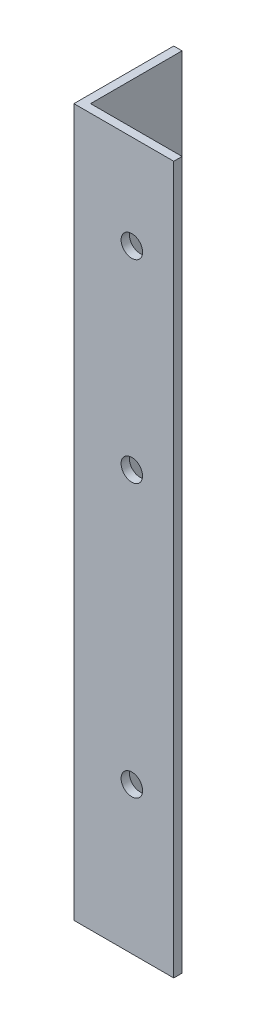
from build123d import *

# Parameters (mm, degrees)
BOSS_EXTRUDE1_DEPTH = 135
SKETCH2_R           = 2.05
CUT_EXTRUDE1_DEPTH  = 138.451232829
SKETCH3_R           = 2.05
CUT_EXTRUDE2_DEPTH  = 138.451232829
SKETCH6_R           = 9.65
CUT_EXTRUDE5_DEPTH  = 10


with BuildPart() as part:
    # Sketch1 → Boss-Extrude1 (new body)
    with BuildSketch(Plane(origin=(0, 0, 0), x_dir=(1, 0, 0), z_dir=(0, 1, 0))):
        Polygon((0, 0), (19.05, 0), (19.05, 1.5875), (1.5875, 1.5875), (1.5875, 19.05), (0, 19.05), align=None)
    extrude(amount=BOSS_EXTRUDE1_DEPTH)

    # Sketch2 → Cut-Extrude1 (cut, through all)
    with BuildSketch(Plane(origin=(1.5875, 0, 0), x_dir=(0, 0, -1), z_dir=(1, 0, 0))):
        with Locations((11.05, 117)):
            Circle(SKETCH2_R)
        with Locations((11.05, 80)):
            Circle(SKETCH2_R)
        with Locations((11.05, 28)):
            Circle(SKETCH2_R)
    extrude(amount=-CUT_EXTRUDE1_DEPTH, mode=Mode.SUBTRACT)

    # Sketch3 → Cut-Extrude2 (cut, through all)
    with BuildSketch(Plane(origin=(0, 0, -1.5875), x_dir=(-1, 0, 0), z_dir=(0, 0, -1))):
        with Locations((-11.05, 117)):
            Circle(SKETCH3_R)
        with Locations((-11.05, 80)):
            Circle(SKETCH3_R)
        with Locations((-11.05, 28)):
            Circle(SKETCH3_R)
    extrude(amount=-CUT_EXTRUDE2_DEPTH, mode=Mode.SUBTRACT)

    # Sketch6 → Cut-Extrude5 (cut)
    with BuildSketch(Plane(origin=(1.5875, 0, 0), x_dir=(0, 0, -1), z_dir=(1, 0, 0))):
        with Locations((21.95, 105)):
            Circle(SKETCH6_R)
        with Locations((21.95, 20)):
            Circle(SKETCH6_R)
    extrude(amount=-CUT_EXTRUDE5_DEPTH, mode=Mode.SUBTRACT)


solid = part.part
